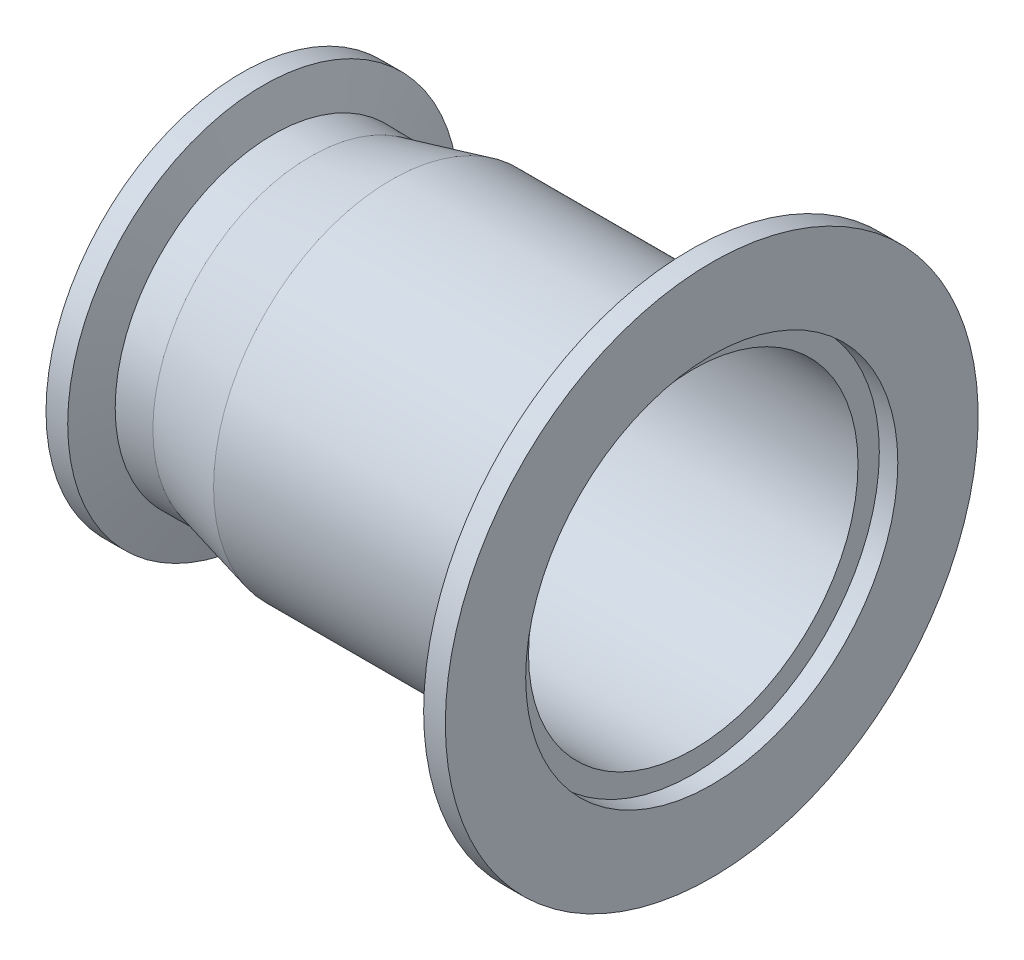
ISO-10303-21;
HEADER;
FILE_DESCRIPTION(('STEP AP214'),'2;1');
FILE_NAME('part.step','',(''),(''),'','','');
FILE_SCHEMA(('AUTOMOTIVE_DESIGN { 1 0 10303 214 1 1 1 1 }'));
ENDSEC;
DATA;
#1=APPLICATION_CONTEXT('core data for automotive mechanical design processes');
#2=APPLICATION_PROTOCOL_DEFINITION('international standard','automotive_design',2000,#1);
#3=PRODUCT_CONTEXT('',#1,'mechanical');
#4=PRODUCT('Part','Part','',(#3));
#5=PRODUCT_RELATED_PRODUCT_CATEGORY('part','',(#4));
#6=PRODUCT_DEFINITION_FORMATION('','',#4);
#7=PRODUCT_DEFINITION_CONTEXT('part definition',#1,'design');
#8=PRODUCT_DEFINITION('design','',#6,#7);
#9=PRODUCT_DEFINITION_SHAPE('','',#8);
#10=(LENGTH_UNIT() NAMED_UNIT(*) SI_UNIT(.MILLI.,.METRE.));
#11=(NAMED_UNIT(*) PLANE_ANGLE_UNIT() SI_UNIT($,.RADIAN.));
#12=(NAMED_UNIT(*) SI_UNIT($,.STERADIAN.) SOLID_ANGLE_UNIT());
#13=UNCERTAINTY_MEASURE_WITH_UNIT(LENGTH_MEASURE(1.E-05),#10,'distance_accuracy_value','');
#14=(GEOMETRIC_REPRESENTATION_CONTEXT(3) GLOBAL_UNCERTAINTY_ASSIGNED_CONTEXT((#13)) GLOBAL_UNIT_ASSIGNED_CONTEXT((#10,
#11,#12)) REPRESENTATION_CONTEXT('',''));
#15=CARTESIAN_POINT('',(0.,0.,0.));
#16=DIRECTION('',(0.,0.,1.));
#17=DIRECTION('',(1.,0.,0.));
#18=AXIS2_PLACEMENT_3D('',#15,#16,#17);
#19=CARTESIAN_POINT('',(66.5851096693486,0.,0.));
#20=DIRECTION('',(1.,0.,0.));
#21=DIRECTION('',(0.,0.,-1.));
#22=AXIS2_PLACEMENT_3D('',#19,#20,#21);
#23=PLANE('',#22);
#24=CARTESIAN_POINT('',(66.5851096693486,0.,14.69801));
#25=DIRECTION('',(-1.,0.,0.));
#26=DIRECTION('',(0.,0.,1.));
#27=AXIS2_PLACEMENT_3D('',#24,#25,#26);
#28=CIRCLE('',#27,23.1649995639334);
#29=CARTESIAN_POINT('',(66.5851096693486,0.,37.8630095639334));
#30=VERTEX_POINT('',#29);
#31=EDGE_CURVE('E87',#30,#30,#28,.T.);
#32=ORIENTED_EDGE('',*,*,#31,.T.);
#33=EDGE_LOOP('',(#32));
#34=FACE_BOUND('',#33,.T.);
#35=CARTESIAN_POINT('',(66.5851096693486,0.,14.69801));
#36=DIRECTION('',(-1.,0.,0.));
#37=DIRECTION('',(0.,0.,1.));
#38=AXIS2_PLACEMENT_3D('',#35,#36,#37);
#39=CIRCLE('',#38,26.1649995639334);
#40=CARTESIAN_POINT('',(66.5851096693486,0.,40.8630095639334));
#41=VERTEX_POINT('',#40);
#42=EDGE_CURVE('E10',#41,#41,#39,.T.);
#43=ORIENTED_EDGE('',*,*,#42,.F.);
#44=EDGE_LOOP('',(#43));
#45=FACE_BOUND('',#44,.T.);
#46=ADVANCED_FACE('F35',(#34,#45),#23,.T.);
#47=CARTESIAN_POINT('',(0.,0.,14.69801));
#48=DIRECTION('',(-1.,0.,0.));
#49=DIRECTION('',(0.,0.,1.));
#50=AXIS2_PLACEMENT_3D('',#47,#48,#49);
#51=CYLINDRICAL_SURFACE('',#50,26.1649995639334);
#52=ORIENTED_EDGE('',*,*,#42,.T.);
#53=EDGE_LOOP('',(#52));
#54=FACE_BOUND('',#53,.T.);
#55=CARTESIAN_POINT('',(69.1851096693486,0.,14.69801));
#56=DIRECTION('',(-1.,0.,0.));
#57=DIRECTION('',(0.,0.,1.));
#58=AXIS2_PLACEMENT_3D('',#55,#56,#57);
#59=CIRCLE('',#58,26.1649995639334);
#60=CARTESIAN_POINT('',(69.1851096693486,0.,40.8630095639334));
#61=VERTEX_POINT('',#60);
#62=EDGE_CURVE('E41',#61,#61,#59,.T.);
#63=ORIENTED_EDGE('',*,*,#62,.F.);
#64=EDGE_LOOP('',(#63));
#65=FACE_BOUND('',#64,.T.);
#66=ADVANCED_FACE('F135',(#54,#65),#51,.F.);
#67=CARTESIAN_POINT('',(69.1851096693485,0.,0.));
#68=DIRECTION('',(1.,0.,0.));
#69=DIRECTION('',(0.,0.,-1.));
#70=AXIS2_PLACEMENT_3D('',#67,#68,#69);
#71=PLANE('',#70);
#72=ORIENTED_EDGE('',*,*,#62,.T.);
#73=EDGE_LOOP('',(#72));
#74=FACE_BOUND('',#73,.T.);
#75=CARTESIAN_POINT('',(69.1851096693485,0.,14.69801));
#76=DIRECTION('',(-1.,0.,0.));
#77=DIRECTION('',(0.,0.,1.));
#78=AXIS2_PLACEMENT_3D('',#75,#76,#77);
#79=CIRCLE('',#78,37.4649995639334);
#80=CARTESIAN_POINT('',(69.1851096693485,0.,52.1630095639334));
#81=VERTEX_POINT('',#80);
#82=EDGE_CURVE('E45',#81,#81,#79,.T.);
#83=ORIENTED_EDGE('',*,*,#82,.F.);
#84=EDGE_LOOP('',(#83));
#85=FACE_BOUND('',#84,.T.);
#86=ADVANCED_FACE('F139',(#74,#85),#71,.T.);
#87=CARTESIAN_POINT('',(0.,0.,14.69801));
#88=DIRECTION('',(-1.,0.,0.));
#89=DIRECTION('',(0.,0.,1.));
#90=AXIS2_PLACEMENT_3D('',#87,#88,#89);
#91=CYLINDRICAL_SURFACE('',#90,37.4649995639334);
#92=ORIENTED_EDGE('',*,*,#82,.T.);
#93=EDGE_LOOP('',(#92));
#94=FACE_BOUND('',#93,.T.);
#95=CARTESIAN_POINT('',(66.1351096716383,0.,14.69801));
#96=DIRECTION('',(-1.,0.,0.));
#97=DIRECTION('',(0.,0.,1.));
#98=AXIS2_PLACEMENT_3D('',#95,#96,#97);
#99=CIRCLE('',#98,37.4649995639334);
#100=CARTESIAN_POINT('',(66.1351096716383,0.,52.1630095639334));
#101=VERTEX_POINT('',#100);
#102=EDGE_CURVE('E49',#101,#101,#99,.T.);
#103=ORIENTED_EDGE('',*,*,#102,.F.);
#104=EDGE_LOOP('',(#103));
#105=FACE_BOUND('',#104,.T.);
#106=ADVANCED_FACE('F143',(#94,#105),#91,.T.);
#107=CARTESIAN_POINT('',(64.1051096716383,0.,14.69801));
#108=DIRECTION('',(1.,0.,0.));
#109=DIRECTION('',(0.,0.,-1.));
#110=AXIS2_PLACEMENT_3D('',#107,#108,#109);
#111=CONICAL_SURFACE('',#110,29.8849995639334,1.30912678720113);
#112=ORIENTED_EDGE('',*,*,#102,.T.);
#113=EDGE_LOOP('',(#112));
#114=FACE_BOUND('',#113,.T.);
#115=CARTESIAN_POINT('',(64.1051096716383,0.,14.69801));
#116=DIRECTION('',(-1.,0.,0.));
#117=DIRECTION('',(0.,0.,1.));
#118=AXIS2_PLACEMENT_3D('',#115,#116,#117);
#119=CIRCLE('',#118,29.8849995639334);
#120=CARTESIAN_POINT('',(64.1051096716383,0.,44.5830095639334));
#121=VERTEX_POINT('',#120);
#122=EDGE_CURVE('E54',#121,#121,#119,.T.);
#123=ORIENTED_EDGE('',*,*,#122,.F.);
#124=EDGE_LOOP('',(#123));
#125=FACE_BOUND('',#124,.T.);
#126=ADVANCED_FACE('F149',(#114,#125),#111,.T.);
#127=CARTESIAN_POINT('',(64.1051096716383,0.,0.));
#128=DIRECTION('',(-1.,0.,0.));
#129=DIRECTION('',(0.,0.,1.));
#130=AXIS2_PLACEMENT_3D('',#127,#128,#129);
#131=PLANE('',#130);
#132=ORIENTED_EDGE('',*,*,#122,.T.);
#133=EDGE_LOOP('',(#132));
#134=FACE_BOUND('',#133,.T.);
#135=CARTESIAN_POINT('',(64.1051096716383,0.,14.69801));
#136=DIRECTION('',(-1.,0.,0.));
#137=DIRECTION('',(0.,0.,1.));
#138=AXIS2_PLACEMENT_3D('',#135,#136,#137);
#139=CIRCLE('',#138,24.9749995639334);
#140=CARTESIAN_POINT('',(64.1051096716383,0.,39.6730095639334));
#141=VERTEX_POINT('',#140);
#142=EDGE_CURVE('E57',#141,#141,#139,.T.);
#143=ORIENTED_EDGE('',*,*,#142,.F.);
#144=EDGE_LOOP('',(#143));
#145=FACE_BOUND('',#144,.T.);
#146=ADVANCED_FACE('F153',(#134,#145),#131,.T.);
#147=CARTESIAN_POINT('',(0.,0.,14.69801));
#148=DIRECTION('',(-1.,0.,0.));
#149=DIRECTION('',(0.,0.,1.));
#150=AXIS2_PLACEMENT_3D('',#147,#148,#149);
#151=CYLINDRICAL_SURFACE('',#150,24.9749995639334);
#152=ORIENTED_EDGE('',*,*,#142,.T.);
#153=EDGE_LOOP('',(#152));
#154=FACE_BOUND('',#153,.T.);
#155=CARTESIAN_POINT('',(24.1051096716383,0.,14.69801));
#156=DIRECTION('',(-1.,0.,0.));
#157=DIRECTION('',(0.,0.,1.));
#158=AXIS2_PLACEMENT_3D('',#155,#156,#157);
#159=CIRCLE('',#158,24.9749995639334);
#160=CARTESIAN_POINT('',(24.1051096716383,0.,39.6730095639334));
#161=VERTEX_POINT('',#160);
#162=EDGE_CURVE('E60',#161,#161,#159,.T.);
#163=ORIENTED_EDGE('',*,*,#162,.F.);
#164=EDGE_LOOP('',(#163));
#165=FACE_BOUND('',#164,.T.);
#166=ADVANCED_FACE('F157',(#154,#165),#151,.T.);
#167=CARTESIAN_POINT('',(12.7623913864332,0.,14.69801));
#168=DIRECTION('',(1.,0.,0.));
#169=DIRECTION('',(0.,0.,-1.));
#170=AXIS2_PLACEMENT_3D('',#167,#168,#169);
#171=CONICAL_SURFACE('',#170,22.1649995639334,0.24284673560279);
#172=ORIENTED_EDGE('',*,*,#162,.T.);
#173=EDGE_LOOP('',(#172));
#174=FACE_BOUND('',#173,.T.);
#175=CARTESIAN_POINT('',(12.7623913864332,0.,14.69801));
#176=DIRECTION('',(-1.,0.,0.));
#177=DIRECTION('',(0.,0.,1.));
#178=AXIS2_PLACEMENT_3D('',#175,#176,#177);
#179=CIRCLE('',#178,22.1649995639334);
#180=CARTESIAN_POINT('',(12.7623913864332,0.,36.8630095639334));
#181=VERTEX_POINT('',#180);
#182=EDGE_CURVE('E63',#181,#181,#179,.T.);
#183=ORIENTED_EDGE('',*,*,#182,.F.);
#184=EDGE_LOOP('',(#183));
#185=FACE_BOUND('',#184,.T.);
#186=ADVANCED_FACE('F161',(#174,#185),#171,.T.);
#187=CARTESIAN_POINT('',(7.52239138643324,0.,14.69801));
#188=DIRECTION('',(-1.,0.,0.));
#189=DIRECTION('',(0.,0.,1.));
#190=AXIS2_PLACEMENT_3D('',#187,#188,#189);
#191=CONICAL_SURFACE('',#190,22.2249995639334,0.0114498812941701);
#192=ORIENTED_EDGE('',*,*,#182,.T.);
#193=EDGE_LOOP('',(#192));
#194=FACE_BOUND('',#193,.T.);
#195=CARTESIAN_POINT('',(7.52239138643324,0.,14.69801));
#196=DIRECTION('',(-1.,0.,0.));
#197=DIRECTION('',(0.,0.,1.));
#198=AXIS2_PLACEMENT_3D('',#195,#196,#197);
#199=CIRCLE('',#198,22.2249995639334);
#200=CARTESIAN_POINT('',(7.52239138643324,0.,36.9230095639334));
#201=VERTEX_POINT('',#200);
#202=EDGE_CURVE('E66',#201,#201,#199,.T.);
#203=ORIENTED_EDGE('',*,*,#202,.F.);
#204=EDGE_LOOP('',(#203));
#205=FACE_BOUND('',#204,.T.);
#206=ADVANCED_FACE('F131',(#194,#205),#191,.T.);
#207=CARTESIAN_POINT('',(6.11239138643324,0.,14.69801));
#208=DIRECTION('',(-1.,0.,0.));
#209=DIRECTION('',(0.,0.,1.));
#210=AXIS2_PLACEMENT_3D('',#207,#208,#209);
#211=CONICAL_SURFACE('',#210,27.4949995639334,1.30936739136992);
#212=ORIENTED_EDGE('',*,*,#202,.T.);
#213=EDGE_LOOP('',(#212));
#214=FACE_BOUND('',#213,.T.);
#215=CARTESIAN_POINT('',(6.11239138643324,0.,14.69801));
#216=DIRECTION('',(-1.,0.,0.));
#217=DIRECTION('',(0.,0.,1.));
#218=AXIS2_PLACEMENT_3D('',#215,#216,#217);
#219=CIRCLE('',#218,27.4949995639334);
#220=CARTESIAN_POINT('',(6.11239138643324,0.,42.1930095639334));
#221=VERTEX_POINT('',#220);
#222=EDGE_CURVE('E69',#221,#221,#219,.T.);
#223=ORIENTED_EDGE('',*,*,#222,.F.);
#224=EDGE_LOOP('',(#223));
#225=FACE_BOUND('',#224,.T.);
#226=ADVANCED_FACE('F125',(#214,#225),#211,.T.);
#227=CARTESIAN_POINT('',(0.,0.,14.69801));
#228=DIRECTION('',(-1.,0.,0.));
#229=DIRECTION('',(0.,0.,1.));
#230=AXIS2_PLACEMENT_3D('',#227,#228,#229);
#231=CYLINDRICAL_SURFACE('',#230,27.4949995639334);
#232=ORIENTED_EDGE('',*,*,#222,.T.);
#233=EDGE_LOOP('',(#232));
#234=FACE_BOUND('',#233,.T.);
#235=CARTESIAN_POINT('',(3.06239138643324,0.,14.69801));
#236=DIRECTION('',(-1.,0.,0.));
#237=DIRECTION('',(0.,0.,1.));
#238=AXIS2_PLACEMENT_3D('',#235,#236,#237);
#239=CIRCLE('',#238,27.4949995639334);
#240=CARTESIAN_POINT('',(3.06239138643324,0.,42.1930095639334));
#241=VERTEX_POINT('',#240);
#242=EDGE_CURVE('E72',#241,#241,#239,.T.);
#243=ORIENTED_EDGE('',*,*,#242,.F.);
#244=EDGE_LOOP('',(#243));
#245=FACE_BOUND('',#244,.T.);
#246=ADVANCED_FACE('F120',(#234,#245),#231,.T.);
#247=CARTESIAN_POINT('',(3.06239138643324,0.,0.));
#248=DIRECTION('',(1.,0.,0.));
#249=DIRECTION('',(0.,0.,-1.));
#250=AXIS2_PLACEMENT_3D('',#247,#248,#249);
#251=PLANE('',#250);
#252=CARTESIAN_POINT('',(3.06239138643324,0.,14.69801));
#253=DIRECTION('',(-1.,0.,0.));
#254=DIRECTION('',(0.,0.,1.));
#255=AXIS2_PLACEMENT_3D('',#252,#253,#254);
#256=CIRCLE('',#255,20.5949995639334);
#257=CARTESIAN_POINT('',(3.06239138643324,0.,35.2930095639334));
#258=VERTEX_POINT('',#257);
#259=EDGE_CURVE('E75',#258,#258,#256,.T.);
#260=ORIENTED_EDGE('',*,*,#259,.F.);
#261=EDGE_LOOP('',(#260));
#262=FACE_BOUND('',#261,.T.);
#263=ORIENTED_EDGE('',*,*,#242,.T.);
#264=EDGE_LOOP('',(#263));
#265=FACE_BOUND('',#264,.T.);
#266=ADVANCED_FACE('F114',(#262,#265),#251,.F.);
#267=CARTESIAN_POINT('',(0.,0.,14.69801));
#268=DIRECTION('',(-1.,0.,0.));
#269=DIRECTION('',(0.,0.,1.));
#270=AXIS2_PLACEMENT_3D('',#267,#268,#269);
#271=CYLINDRICAL_SURFACE('',#270,20.5949995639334);
#272=CARTESIAN_POINT('',(5.66239138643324,0.,14.69801));
#273=DIRECTION('',(-1.,0.,0.));
#274=DIRECTION('',(0.,0.,1.));
#275=AXIS2_PLACEMENT_3D('',#272,#273,#274);
#276=CIRCLE('',#275,20.5949995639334);
#277=CARTESIAN_POINT('',(5.66239138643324,0.,35.2930095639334));
#278=VERTEX_POINT('',#277);
#279=EDGE_CURVE('E78',#278,#278,#276,.T.);
#280=ORIENTED_EDGE('',*,*,#279,.F.);
#281=EDGE_LOOP('',(#280));
#282=FACE_BOUND('',#281,.T.);
#283=ORIENTED_EDGE('',*,*,#259,.T.);
#284=EDGE_LOOP('',(#283));
#285=FACE_BOUND('',#284,.T.);
#286=ADVANCED_FACE('F108',(#282,#285),#271,.F.);
#287=CARTESIAN_POINT('',(5.66239138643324,0.,0.));
#288=DIRECTION('',(1.,0.,0.));
#289=DIRECTION('',(0.,0.,-1.));
#290=AXIS2_PLACEMENT_3D('',#287,#288,#289);
#291=PLANE('',#290);
#292=CARTESIAN_POINT('',(5.66239138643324,0.,14.69801));
#293=DIRECTION('',(-1.,0.,0.));
#294=DIRECTION('',(0.,0.,1.));
#295=AXIS2_PLACEMENT_3D('',#292,#293,#294);
#296=CIRCLE('',#295,17.5949995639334);
#297=CARTESIAN_POINT('',(5.66239138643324,0.,32.2930095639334));
#298=VERTEX_POINT('',#297);
#299=EDGE_CURVE('E81',#298,#298,#296,.T.);
#300=ORIENTED_EDGE('',*,*,#299,.F.);
#301=EDGE_LOOP('',(#300));
#302=FACE_BOUND('',#301,.T.);
#303=ORIENTED_EDGE('',*,*,#279,.T.);
#304=EDGE_LOOP('',(#303));
#305=FACE_BOUND('',#304,.T.);
#306=ADVANCED_FACE('F102',(#302,#305),#291,.F.);
#307=CARTESIAN_POINT('',(5.66239138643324,0.,14.69801));
#308=DIRECTION('',(1.,0.,0.));
#309=DIRECTION('',(0.,0.,-1.));
#310=AXIS2_PLACEMENT_3D('',#307,#308,#309);
#311=CONICAL_SURFACE('',#310,17.5949995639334,0.24284673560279);
#312=CARTESIAN_POINT('',(28.1460002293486,0.,14.69801));
#313=DIRECTION('',(-1.,0.,0.));
#314=DIRECTION('',(0.,0.,1.));
#315=AXIS2_PLACEMENT_3D('',#312,#313,#314);
#316=CIRCLE('',#315,23.1649995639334);
#317=CARTESIAN_POINT('',(28.1460002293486,0.,37.8630095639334));
#318=VERTEX_POINT('',#317);
#319=EDGE_CURVE('E84',#318,#318,#316,.T.);
#320=ORIENTED_EDGE('',*,*,#319,.F.);
#321=EDGE_LOOP('',(#320));
#322=FACE_BOUND('',#321,.T.);
#323=ORIENTED_EDGE('',*,*,#299,.T.);
#324=EDGE_LOOP('',(#323));
#325=FACE_BOUND('',#324,.T.);
#326=ADVANCED_FACE('F96',(#322,#325),#311,.F.);
#327=CARTESIAN_POINT('',(0.,0.,14.69801));
#328=DIRECTION('',(-1.,0.,0.));
#329=DIRECTION('',(0.,0.,1.));
#330=AXIS2_PLACEMENT_3D('',#327,#328,#329);
#331=CYLINDRICAL_SURFACE('',#330,23.1649995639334);
#332=ORIENTED_EDGE('',*,*,#31,.F.);
#333=EDGE_LOOP('',(#332));
#334=FACE_BOUND('',#333,.T.);
#335=ORIENTED_EDGE('',*,*,#319,.T.);
#336=EDGE_LOOP('',(#335));
#337=FACE_BOUND('',#336,.T.);
#338=ADVANCED_FACE('F93',(#334,#337),#331,.F.);
#339=CLOSED_SHELL('',(#46,#66,#86,#106,#126,#146,#166,#186,#206,#226,#246,#266,#286,#306,#326,#338));
#340=MANIFOLD_SOLID_BREP('B2',#339);
#341=ADVANCED_BREP_SHAPE_REPRESENTATION('',(#18,#340),#14);
#342=SHAPE_DEFINITION_REPRESENTATION(#9,#341);
ENDSEC;
END-ISO-10303-21;
